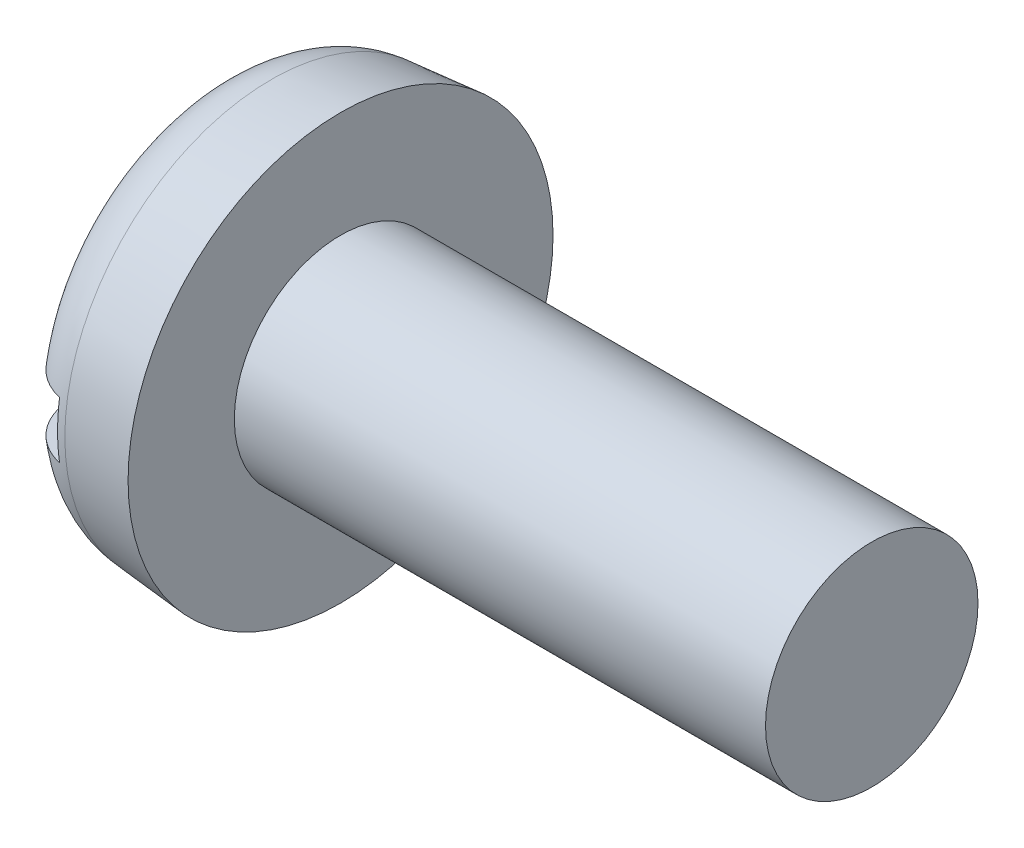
ISO-10303-21;
HEADER;
FILE_DESCRIPTION(('STEP AP214'),'2;1');
FILE_NAME('part.step','',(''),(''),'','','');
FILE_SCHEMA(('AUTOMOTIVE_DESIGN { 1 0 10303 214 1 1 1 1 }'));
ENDSEC;
DATA;
#1=APPLICATION_CONTEXT('core data for automotive mechanical design processes');
#2=APPLICATION_PROTOCOL_DEFINITION('international standard','automotive_design',2000,#1);
#3=PRODUCT_CONTEXT('',#1,'mechanical');
#4=PRODUCT('Part','Part','',(#3));
#5=PRODUCT_RELATED_PRODUCT_CATEGORY('part','',(#4));
#6=PRODUCT_DEFINITION_FORMATION('','',#4);
#7=PRODUCT_DEFINITION_CONTEXT('part definition',#1,'design');
#8=PRODUCT_DEFINITION('design','',#6,#7);
#9=PRODUCT_DEFINITION_SHAPE('','',#8);
#10=(LENGTH_UNIT() NAMED_UNIT(*) SI_UNIT(.MILLI.,.METRE.));
#11=(NAMED_UNIT(*) PLANE_ANGLE_UNIT() SI_UNIT($,.RADIAN.));
#12=(NAMED_UNIT(*) SI_UNIT($,.STERADIAN.) SOLID_ANGLE_UNIT());
#13=UNCERTAINTY_MEASURE_WITH_UNIT(LENGTH_MEASURE(1.E-05),#10,'distance_accuracy_value','');
#14=(GEOMETRIC_REPRESENTATION_CONTEXT(3) GLOBAL_UNCERTAINTY_ASSIGNED_CONTEXT((#13)) GLOBAL_UNIT_ASSIGNED_CONTEXT((#10,
#11,#12)) REPRESENTATION_CONTEXT('',''));
#15=CARTESIAN_POINT('',(0.,0.,0.));
#16=DIRECTION('',(0.,0.,1.));
#17=DIRECTION('',(1.,0.,0.));
#18=AXIS2_PLACEMENT_3D('',#15,#16,#17);
#19=CARTESIAN_POINT('',(0.,0.,0.));
#20=DIRECTION('',(-1.,0.,0.));
#21=DIRECTION('',(0.,0.,1.));
#22=AXIS2_PLACEMENT_3D('',#19,#20,#21);
#23=PLANE('',#22);
#24=DIRECTION('',(0.,0.,-1.));
#25=VECTOR('',#24,1.);
#26=CARTESIAN_POINT('',(0.,0.799999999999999,6.));
#27=LINE('',#26,#25);
#28=CARTESIAN_POINT('',(0.,0.799999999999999,3.9555566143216));
#29=VERTEX_POINT('',#28);
#30=CARTESIAN_POINT('',(0.,0.799999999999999,-3.9555566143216));
#31=VERTEX_POINT('',#30);
#32=EDGE_CURVE('E85',#29,#31,#27,.T.);
#33=ORIENTED_EDGE('',*,*,#32,.F.);
#34=CARTESIAN_POINT('',(0.,0.,0.));
#35=DIRECTION('',(-1.,0.,0.));
#36=DIRECTION('',(0.,0.,1.));
#37=AXIS2_PLACEMENT_3D('',#34,#35,#36);
#38=CIRCLE('',#37,4.03564469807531);
#39=EDGE_CURVE('E91',#29,#31,#38,.T.);
#40=ORIENTED_EDGE('',*,*,#39,.T.);
#41=EDGE_LOOP('',(#33,#40));
#42=FACE_BOUND('',#41,.T.);
#43=ADVANCED_FACE('F32',(#42),#23,.T.);
#44=CARTESIAN_POINT('',(-25.4,0.,0.));
#45=DIRECTION('',(-1.,0.,0.));
#46=DIRECTION('',(0.,0.,1.));
#47=AXIS2_PLACEMENT_3D('',#44,#45,#46);
#48=CYLINDRICAL_SURFACE('',#47,3.);
#49=CARTESIAN_POINT('',(18.6,0.,0.));
#50=DIRECTION('',(-1.,0.,0.));
#51=DIRECTION('',(0.,0.,1.));
#52=AXIS2_PLACEMENT_3D('',#49,#50,#51);
#53=CIRCLE('',#52,3.);
#54=CARTESIAN_POINT('',(18.6,0.,3.));
#55=VERTEX_POINT('',#54);
#56=EDGE_CURVE('E92',#55,#55,#53,.T.);
#57=ORIENTED_EDGE('',*,*,#56,.T.);
#58=EDGE_LOOP('',(#57));
#59=FACE_BOUND('',#58,.T.);
#60=CARTESIAN_POINT('',(3.6,0.,0.));
#61=DIRECTION('',(-1.,0.,0.));
#62=DIRECTION('',(0.,0.,1.));
#63=AXIS2_PLACEMENT_3D('',#60,#61,#62);
#64=CIRCLE('',#63,3.);
#65=CARTESIAN_POINT('',(3.6,0.,3.));
#66=VERTEX_POINT('',#65);
#67=EDGE_CURVE('E149',#66,#66,#64,.T.);
#68=ORIENTED_EDGE('',*,*,#67,.F.);
#69=EDGE_LOOP('',(#68));
#70=FACE_BOUND('',#69,.T.);
#71=ADVANCED_FACE('F137',(#59,#70),#48,.T.);
#72=CARTESIAN_POINT('',(18.6,3.,0.));
#73=DIRECTION('',(1.,0.,0.));
#74=DIRECTION('',(0.,0.,-1.));
#75=AXIS2_PLACEMENT_3D('',#72,#73,#74);
#76=PLANE('',#75);
#77=ORIENTED_EDGE('',*,*,#56,.F.);
#78=EDGE_LOOP('',(#77));
#79=FACE_BOUND('',#78,.T.);
#80=ADVANCED_FACE('F135',(#79),#76,.T.);
#81=DIRECTION('',(0.,0.,1.));
#82=VECTOR('',#81,1.);
#83=CARTESIAN_POINT('',(0.,-0.799999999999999,-6.));
#84=LINE('',#83,#82);
#85=CARTESIAN_POINT('',(0.,-0.799999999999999,-3.9555566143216));
#86=VERTEX_POINT('',#85);
#87=CARTESIAN_POINT('',(0.,-0.800000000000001,3.9555566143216));
#88=VERTEX_POINT('',#87);
#89=EDGE_CURVE('E76',#86,#88,#84,.T.);
#90=ORIENTED_EDGE('',*,*,#89,.F.);
#91=EDGE_CURVE('E83',#86,#88,#38,.T.);
#92=ORIENTED_EDGE('',*,*,#91,.T.);
#93=EDGE_LOOP('',(#90,#92));
#94=FACE_BOUND('',#93,.T.);
#95=ADVANCED_FACE('F82',(#94),#23,.T.);
#96=CARTESIAN_POINT('',(0.,0.,0.));
#97=DIRECTION('',(1.,0.,0.));
#98=DIRECTION('',(0.,0.,-1.));
#99=AXIS2_PLACEMENT_3D('',#96,#97,#98);
#100=CONICAL_SURFACE('',#99,5.68504081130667,0.0872664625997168);
#101=CARTESIAN_POINT('',(1.64311966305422,0.,0.));
#102=DIRECTION('',(-1.,0.,0.));
#103=DIRECTION('',(0.,0.,1.));
#104=AXIS2_PLACEMENT_3D('',#101,#102,#103);
#105=CIRCLE('',#104,5.82879515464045);
#106=CARTESIAN_POINT('',(1.64311966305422,0.,5.82879515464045));
#107=VERTEX_POINT('',#106);
#108=EDGE_CURVE('E95',#107,#107,#105,.F.);
#109=ORIENTED_EDGE('',*,*,#108,.T.);
#110=EDGE_LOOP('',(#109));
#111=FACE_BOUND('',#110,.T.);
#112=CARTESIAN_POINT('',(3.6,0.,0.));
#113=DIRECTION('',(-1.,0.,0.));
#114=DIRECTION('',(0.,0.,1.));
#115=AXIS2_PLACEMENT_3D('',#112,#113,#114);
#116=CIRCLE('',#115,6.);
#117=CARTESIAN_POINT('',(3.6,0.,6.));
#118=VERTEX_POINT('',#117);
#119=EDGE_CURVE('E97',#118,#118,#116,.T.);
#120=ORIENTED_EDGE('',*,*,#119,.T.);
#121=EDGE_LOOP('',(#120));
#122=FACE_BOUND('',#121,.T.);
#123=ADVANCED_FACE('F128',(#111,#122),#100,.T.);
#124=CARTESIAN_POINT('',(3.6,3.,0.));
#125=DIRECTION('',(-1.,0.,0.));
#126=DIRECTION('',(0.,0.,1.));
#127=AXIS2_PLACEMENT_3D('',#124,#125,#126);
#128=PLANE('',#127);
#129=ORIENTED_EDGE('',*,*,#119,.F.);
#130=EDGE_LOOP('',(#129));
#131=FACE_BOUND('',#130,.T.);
#132=ORIENTED_EDGE('',*,*,#67,.T.);
#133=EDGE_LOOP('',(#132));
#134=FACE_BOUND('',#133,.T.);
#135=ADVANCED_FACE('F124',(#131,#134),#128,.F.);
#136=CARTESIAN_POINT('',(1.8,0.,0.));
#137=DIRECTION('',(-1.,0.,0.));
#138=DIRECTION('',(0.,0.,1.));
#139=AXIS2_PLACEMENT_3D('',#136,#137,#138);
#140=TOROIDAL_SURFACE('',#139,4.03564469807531,1.8);
#141=CARTESIAN_POINT('',(0.540762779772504,0.799999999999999,-5.2613759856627));
#142=CARTESIAN_POINT('',(0.612348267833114,0.799999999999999,-5.33226007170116));
#143=CARTESIAN_POINT('',(0.689931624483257,0.799999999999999,-5.3971854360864));
#144=CARTESIAN_POINT('',(0.854947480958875,0.799999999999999,-5.51316161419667));
#145=CARTESIAN_POINT('',(0.94239068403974,0.799999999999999,-5.56419714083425));
#146=CARTESIAN_POINT('',(1.12461220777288,0.799999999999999,-5.650821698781));
#147=CARTESIAN_POINT('',(1.21938917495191,0.799999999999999,-5.6864135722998));
#148=CARTESIAN_POINT('',(1.41356630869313,0.799999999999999,-5.74109194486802));
#149=CARTESIAN_POINT('',(1.51296538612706,0.799999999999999,-5.76018231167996));
#150=CARTESIAN_POINT('',(1.71313899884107,0.799999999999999,-5.78126121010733));
#151=CARTESIAN_POINT('',(1.81390602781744,0.799999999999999,-5.78332104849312));
#152=CARTESIAN_POINT('',(2.01435310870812,0.799999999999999,-5.77046455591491));
#153=CARTESIAN_POINT('',(2.11403314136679,0.799999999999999,-5.75554792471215));
#154=CARTESIAN_POINT('',(2.309314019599,0.799999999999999,-5.70921606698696));
#155=CARTESIAN_POINT('',(2.40492104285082,0.799999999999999,-5.67782686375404));
#156=CARTESIAN_POINT('',(2.58952927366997,0.799999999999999,-5.59948776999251));
#157=CARTESIAN_POINT('',(2.67853045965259,0.799999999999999,-5.55253782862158));
#158=CARTESIAN_POINT('',(2.84769451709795,0.799999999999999,-5.44428887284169));
#159=CARTESIAN_POINT('',(2.92783091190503,0.799999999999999,-5.38294849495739));
#160=CARTESIAN_POINT('',(3.07676159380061,0.799999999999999,-5.24777626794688));
#161=CARTESIAN_POINT('',(3.1455556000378,0.799999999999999,-5.17394410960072));
#162=CARTESIAN_POINT('',(3.27042510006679,0.799999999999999,-5.01531035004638));
#163=CARTESIAN_POINT('',(3.32640120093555,0.799999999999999,-4.93043053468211));
#164=CARTESIAN_POINT('',(3.4235057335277,0.799999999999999,-4.75256933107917));
#165=CARTESIAN_POINT('',(3.46463341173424,0.799999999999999,-4.65958753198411));
#166=CARTESIAN_POINT('',(3.53144158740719,0.799999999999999,-4.46694835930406));
#167=CARTESIAN_POINT('',(3.55692557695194,0.799999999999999,-4.36722286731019));
#168=CARTESIAN_POINT('',(3.59108701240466,0.799999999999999,-4.16493761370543));
#169=CARTESIAN_POINT('',(3.59976314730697,0.799999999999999,-4.06237763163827));
#170=CARTESIAN_POINT('',(3.60023112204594,0.799999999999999,-3.85550711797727));
#171=CARTESIAN_POINT('',(3.59173848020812,0.799999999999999,-3.75119596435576));
#172=CARTESIAN_POINT('',(3.55768438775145,0.799999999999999,-3.54539907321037));
#173=CARTESIAN_POINT('',(3.53212117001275,0.799999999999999,-3.44391362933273));
#174=CARTESIAN_POINT('',(3.46412322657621,0.799999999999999,-3.24471369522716));
#175=CARTESIAN_POINT('',(3.42139292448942,0.799999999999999,-3.14710004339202));
#176=CARTESIAN_POINT('',(3.32030286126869,0.799999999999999,-2.96031799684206));
#177=CARTESIAN_POINT('',(3.26194098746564,0.799999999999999,-2.87115074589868));
#178=CARTESIAN_POINT('',(3.13053846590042,0.799999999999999,-2.70303664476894));
#179=CARTESIAN_POINT('',(3.05736818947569,0.799999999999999,-2.62419095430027));
#180=CARTESIAN_POINT('',(2.89859048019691,0.799999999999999,-2.48017518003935));
#181=CARTESIAN_POINT('',(2.81298317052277,0.799999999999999,-2.41500496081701));
#182=CARTESIAN_POINT('',(2.6334271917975,0.799999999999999,-2.30187272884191));
#183=CARTESIAN_POINT('',(2.53967929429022,0.799999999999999,-2.25359299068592));
#184=CARTESIAN_POINT('',(2.34507363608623,0.799999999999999,-2.17455467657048));
#185=CARTESIAN_POINT('',(2.24421969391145,0.799999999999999,-2.14378676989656));
#186=CARTESIAN_POINT('',(2.04443930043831,0.799999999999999,-2.10254396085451));
#187=CARTESIAN_POINT('',(1.94573097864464,0.799999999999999,-2.09101175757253));
#188=CARTESIAN_POINT('',(1.74783816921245,0.799999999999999,-2.08550669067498));
#189=CARTESIAN_POINT('',(1.64865381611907,0.799999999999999,-2.09152912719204));
#190=CARTESIAN_POINT('',(1.45702700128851,0.799999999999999,-2.12018138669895));
#191=CARTESIAN_POINT('',(1.36447664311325,0.799999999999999,-2.14209986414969));
#192=CARTESIAN_POINT('',(1.18420660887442,0.799999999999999,-2.20075771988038));
#193=CARTESIAN_POINT('',(1.09648771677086,0.799999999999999,-2.23749949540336));
#194=CARTESIAN_POINT('',(0.925723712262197,0.799999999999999,-2.32557805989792));
#195=CARTESIAN_POINT('',(0.842868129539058,0.799999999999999,-2.37728131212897));
#196=CARTESIAN_POINT('',(0.686362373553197,0.799999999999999,-2.493116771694));
#197=CARTESIAN_POINT('',(0.612714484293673,0.799999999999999,-2.55725205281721));
#198=CARTESIAN_POINT('',(0.472161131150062,0.799999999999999,-2.70027682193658));
#199=CARTESIAN_POINT('',(0.405916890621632,0.799999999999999,-2.77981681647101));
#200=CARTESIAN_POINT('',(0.287173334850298,0.799999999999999,-2.9485732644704));
#201=CARTESIAN_POINT('',(0.234676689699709,0.799999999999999,-3.03779159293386));
#202=CARTESIAN_POINT('',(0.143214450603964,0.799999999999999,-3.22677844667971));
#203=CARTESIAN_POINT('',(0.104782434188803,0.799999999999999,-3.32680584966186));
#204=CARTESIAN_POINT('',(0.0452446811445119,0.799999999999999,-3.5318922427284));
#205=CARTESIAN_POINT('',(0.0241387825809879,0.799999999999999,-3.63695118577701));
#206=CARTESIAN_POINT('',(-1.12670491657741E-05,0.799999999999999,-3.84916824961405));
#207=CARTESIAN_POINT('',(-0.00304965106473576,0.799999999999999,-3.95632702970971));
#208=CARTESIAN_POINT('',(0.00921984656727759,0.799999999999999,-4.16962319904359));
#209=CARTESIAN_POINT('',(0.0245310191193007,0.799999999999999,-4.27576040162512));
#210=CARTESIAN_POINT('',(0.0728327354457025,0.799999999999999,-4.48216521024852));
#211=CARTESIAN_POINT('',(0.105541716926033,0.799999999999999,-4.58249883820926));
#212=CARTESIAN_POINT('',(0.187634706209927,0.799999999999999,-4.77599767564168));
#213=CARTESIAN_POINT('',(0.236996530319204,0.799999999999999,-4.86917222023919));
#214=CARTESIAN_POINT('',(0.329466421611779,0.799999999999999,-5.01228034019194));
#215=CARTESIAN_POINT('',(0.367921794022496,0.799999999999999,-5.06527765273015));
#216=CARTESIAN_POINT('',(0.450329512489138,0.799999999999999,-5.16681267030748));
#217=CARTESIAN_POINT('',(0.494281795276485,0.799999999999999,-5.21535042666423));
#218=CARTESIAN_POINT('',(0.540762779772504,0.799999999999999,-5.2613759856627));
#219=B_SPLINE_CURVE_WITH_KNOTS('',3,(#141,#142,#143,#144,#145,#146,#147,#148,#149,#150,#151,
#152,#153,#154,#155,#156,#157,#158,#159,#160,#161,#162,#163,#164,#165,#166,#167,#168,#169,#170,
#171,#172,#173,#174,#175,#176,#177,#178,#179,#180,#181,#182,#183,#184,#185,#186,#187,#188,#189,
#190,#191,#192,#193,#194,#195,#196,#197,#198,#199,#200,#201,#202,#203,#204,#205,#206,#207,#208,
#209,#210,#211,#212,#213,#214,#215,#216,#217,#218),.UNSPECIFIED.,.T.,.F.,(4,2,2,2,2,2,2,2,2,2,2,
2,2,2,2,2,2,2,2,2,2,2,2,2,2,2,2,2,2,2,2,2,2,2,2,2,2,2,4),(0.,0.301990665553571,
0.604312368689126,0.906578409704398,1.20877358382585,1.50970282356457,1.81063738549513,
2.11109795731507,2.41155951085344,2.71289551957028,3.01423898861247,3.31784547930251,
3.6214673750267,3.92882908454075,4.23621476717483,4.54873547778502,4.86128854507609,
5.17947093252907,5.49769634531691,5.81883829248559,6.13997705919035,6.45470120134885,
6.76925749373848,7.06587349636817,7.36241009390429,7.64643650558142,7.93050886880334,
8.22223277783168,8.51402890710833,8.8231740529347,9.13237919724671,9.45232886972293,
9.77227555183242,10.0923243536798,10.4124305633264,10.7275071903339,11.042165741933,
11.2382527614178,11.4343375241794),.UNSPECIFIED.);
#220=CARTESIAN_POINT('',(1.4,0.799999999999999,-5.73510972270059));
#221=VERTEX_POINT('',#220);
#222=EDGE_CURVE('E11',#31,#221,#219,.T.);
#223=ORIENTED_EDGE('',*,*,#222,.F.);
#224=ORIENTED_EDGE('',*,*,#39,.F.);
#225=CARTESIAN_POINT('',(0.836266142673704,0.799999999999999,2.3847675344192));
#226=CARTESIAN_POINT('',(0.917616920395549,0.799999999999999,2.33037611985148));
#227=CARTESIAN_POINT('',(1.00338812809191,0.799999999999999,2.28250940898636));
#228=CARTESIAN_POINT('',(1.18171371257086,0.799999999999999,2.20157945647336));
#229=CARTESIAN_POINT('',(1.27427138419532,0.799999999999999,2.16852346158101));
#230=CARTESIAN_POINT('',(1.46387360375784,0.799999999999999,2.11861651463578));
#231=CARTESIAN_POINT('',(1.56092620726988,0.799999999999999,2.10179593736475));
#232=CARTESIAN_POINT('',(1.75645828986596,0.799999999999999,2.08531619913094));
#233=CARTESIAN_POINT('',(1.85493729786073,0.799999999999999,2.08565149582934));
#234=CARTESIAN_POINT('',(2.04724581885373,0.799999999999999,2.10316628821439));
#235=CARTESIAN_POINT('',(2.1411242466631,0.799999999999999,2.11981673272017));
#236=CARTESIAN_POINT('',(2.32483197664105,0.799999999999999,2.16840533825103));
#237=CARTESIAN_POINT('',(2.41466058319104,0.799999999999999,2.20034611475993));
#238=CARTESIAN_POINT('',(2.58937479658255,0.799999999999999,2.27883470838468));
#239=CARTESIAN_POINT('',(2.67416016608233,0.799999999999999,2.32560484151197));
#240=CARTESIAN_POINT('',(2.83527159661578,0.799999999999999,2.43194790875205));
#241=CARTESIAN_POINT('',(2.91159566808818,0.799999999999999,2.4915238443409));
#242=CARTESIAN_POINT('',(3.05833847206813,0.799999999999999,2.62557742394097));
#243=CARTESIAN_POINT('',(3.12814463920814,0.799999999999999,2.70072607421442));
#244=CARTESIAN_POINT('',(3.25476371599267,0.799999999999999,2.86127427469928));
#245=CARTESIAN_POINT('',(3.31157384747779,0.799999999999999,2.94667601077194));
#246=CARTESIAN_POINT('',(3.41282909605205,0.799999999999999,3.12914373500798));
#247=CARTESIAN_POINT('',(3.4566732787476,0.799999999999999,3.22654397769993));
#248=CARTESIAN_POINT('',(3.52749042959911,0.799999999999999,3.42730182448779));
#249=CARTESIAN_POINT('',(3.55446245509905,0.799999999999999,3.53065976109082));
#250=CARTESIAN_POINT('',(3.59074777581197,0.799999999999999,3.74099682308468));
#251=CARTESIAN_POINT('',(3.59996828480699,0.799999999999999,3.84799201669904));
#252=CARTESIAN_POINT('',(3.60003154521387,0.799999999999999,4.06199242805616));
#253=CARTESIAN_POINT('',(3.59087543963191,0.799999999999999,4.16899764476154));
#254=CARTESIAN_POINT('',(3.5545508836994,0.799999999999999,4.37828946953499));
#255=CARTESIAN_POINT('',(3.5276490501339,0.799999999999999,4.48062230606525));
#256=CARTESIAN_POINT('',(3.45672417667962,0.799999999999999,4.67917518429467));
#257=CARTESIAN_POINT('',(3.41270279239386,0.799999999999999,4.77539581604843));
#258=CARTESIAN_POINT('',(3.30967441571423,0.799999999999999,4.95711293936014));
#259=CARTESIAN_POINT('',(3.2509575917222,0.799999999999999,5.04277397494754));
#260=CARTESIAN_POINT('',(3.11977209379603,0.799999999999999,5.20282644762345));
#261=CARTESIAN_POINT('',(3.04730458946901,0.799999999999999,5.27721884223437));
#262=CARTESIAN_POINT('',(2.89186263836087,0.799999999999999,5.41145672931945));
#263=CARTESIAN_POINT('',(2.80906226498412,0.799999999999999,5.47150384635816));
#264=CARTESIAN_POINT('',(2.63447307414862,0.799999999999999,5.57667826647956));
#265=CARTESIAN_POINT('',(2.54268479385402,0.799999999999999,5.62180646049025));
#266=CARTESIAN_POINT('',(2.35372245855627,0.799999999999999,5.69541178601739));
#267=CARTESIAN_POINT('',(2.25661170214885,0.799999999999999,5.72405148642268));
#268=CARTESIAN_POINT('',(2.05894963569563,0.799999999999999,5.76452632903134));
#269=CARTESIAN_POINT('',(1.95839844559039,0.799999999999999,5.77636205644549));
#270=CARTESIAN_POINT('',(1.75726466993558,0.799999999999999,5.78286013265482));
#271=CARTESIAN_POINT('',(1.65668492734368,0.799999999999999,5.77761084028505));
#272=CARTESIAN_POINT('',(1.45783846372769,0.799999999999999,5.75028865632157));
#273=CARTESIAN_POINT('',(1.35957171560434,0.799999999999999,5.72821596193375));
#274=CARTESIAN_POINT('',(1.16819371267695,0.799999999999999,5.66791633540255));
#275=CARTESIAN_POINT('',(1.07507939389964,0.799999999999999,5.62969912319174));
#276=CARTESIAN_POINT('',(0.896555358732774,0.799999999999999,5.53823241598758));
#277=CARTESIAN_POINT('',(0.811145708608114,0.799999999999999,5.4849827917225));
#278=CARTESIAN_POINT('',(0.650082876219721,0.799999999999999,5.36476593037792));
#279=CARTESIAN_POINT('',(0.574468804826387,0.799999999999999,5.29774630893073));
#280=CARTESIAN_POINT('',(0.435451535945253,0.799999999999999,5.15205983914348));
#281=CARTESIAN_POINT('',(0.372048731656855,0.799999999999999,5.07339261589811));
#282=CARTESIAN_POINT('',(0.258650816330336,0.799999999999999,4.90594446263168));
#283=CARTESIAN_POINT('',(0.208774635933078,0.799999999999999,4.81708301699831));
#284=CARTESIAN_POINT('',(0.124428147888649,0.799999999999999,4.63233098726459));
#285=CARTESIAN_POINT('',(0.0899587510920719,0.799999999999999,4.53643998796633));
#286=CARTESIAN_POINT('',(0.0368868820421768,0.799999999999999,4.33899079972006));
#287=CARTESIAN_POINT('',(0.0185025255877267,0.799999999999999,4.23737401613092));
#288=CARTESIAN_POINT('',(-0.00125734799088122,0.799999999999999,4.03250747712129));
#289=CARTESIAN_POINT('',(-0.00263209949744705,0.799999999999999,3.9292576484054));
#290=CARTESIAN_POINT('',(0.0116307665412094,0.799999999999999,3.72214563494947));
#291=CARTESIAN_POINT('',(0.0275632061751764,0.799999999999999,3.61830377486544));
#292=CARTESIAN_POINT('',(0.0763335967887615,0.799999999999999,3.41464106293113));
#293=CARTESIAN_POINT('',(0.10917724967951,0.799999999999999,3.31482157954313));
#294=CARTESIAN_POINT('',(0.191511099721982,0.799999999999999,3.12021092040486));
#295=CARTESIAN_POINT('',(0.241286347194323,0.799999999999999,3.02554040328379));
#296=CARTESIAN_POINT('',(0.355915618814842,0.799999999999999,2.8458978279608));
#297=CARTESIAN_POINT('',(0.420755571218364,0.799999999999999,2.76091682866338));
#298=CARTESIAN_POINT('',(0.543269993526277,0.799999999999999,2.62572980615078));
#299=CARTESIAN_POINT('',(0.597683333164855,0.799999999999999,2.57253239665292));
#300=CARTESIAN_POINT('',(0.712598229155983,0.799999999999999,2.4731680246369));
#301=CARTESIAN_POINT('',(0.773099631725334,0.799999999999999,2.42700088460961));
#302=CARTESIAN_POINT('',(0.836266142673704,0.799999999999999,2.3847675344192));
#303=B_SPLINE_CURVE_WITH_KNOTS('',3,(#225,#226,#227,#228,#229,#230,#231,#232,#233,#234,#235,
#236,#237,#238,#239,#240,#241,#242,#243,#244,#245,#246,#247,#248,#249,#250,#251,#252,#253,#254,
#255,#256,#257,#258,#259,#260,#261,#262,#263,#264,#265,#266,#267,#268,#269,#270,#271,#272,#273,
#274,#275,#276,#277,#278,#279,#280,#281,#282,#283,#284,#285,#286,#287,#288,#289,#290,#291,#292,
#293,#294,#295,#296,#297,#298,#299,#300,#301,#302),.UNSPECIFIED.,.T.,.F.,(4,2,2,2,2,2,2,2,2,2,2,
2,2,2,2,2,2,2,2,2,2,2,2,2,2,2,2,2,2,2,2,2,2,2,2,2,2,2,4),(0.,0.293321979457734,
0.586787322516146,0.880800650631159,1.17471899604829,1.45941156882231,1.74415285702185,
2.03338255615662,2.32268012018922,2.62901646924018,2.93541824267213,3.25435495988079,
3.57330949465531,3.89392670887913,4.21452398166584,4.53041098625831,4.84626744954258,
5.1563211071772,5.46634840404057,5.77172128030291,6.0770759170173,6.37936593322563,
6.6816454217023,6.98236409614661,7.2830792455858,7.5836136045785,7.88415054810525,
8.18585270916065,8.48756458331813,8.79184901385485,9.09615143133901,9.40451898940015,
9.71290042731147,10.0266186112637,10.3404426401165,10.6598354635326,10.9789311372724,
11.2066928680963,11.43444884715),.UNSPECIFIED.);
#304=CARTESIAN_POINT('',(1.4,0.799999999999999,5.73510972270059));
#305=VERTEX_POINT('',#304);
#306=EDGE_CURVE('E109',#305,#29,#303,.T.);
#307=ORIENTED_EDGE('',*,*,#306,.F.);
#308=CARTESIAN_POINT('',(1.4,0.,0.));
#309=DIRECTION('',(-1.,0.,0.));
#310=DIRECTION('',(0.,0.,1.));
#311=AXIS2_PLACEMENT_3D('',#308,#309,#310);
#312=CIRCLE('',#311,5.79063757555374);
#313=CARTESIAN_POINT('',(1.4,-0.800000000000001,5.73510972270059));
#314=VERTEX_POINT('',#313);
#315=EDGE_CURVE('E103',#305,#314,#312,.F.);
#316=ORIENTED_EDGE('',*,*,#315,.T.);
#317=CARTESIAN_POINT('',(0.836266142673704,-0.8,2.3847675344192));
#318=CARTESIAN_POINT('',(0.748506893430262,-0.8,2.44345191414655));
#319=CARTESIAN_POINT('',(0.665766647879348,-0.8,2.50981960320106));
#320=CARTESIAN_POINT('',(0.512551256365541,-0.8,2.65561376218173));
#321=CARTESIAN_POINT('',(0.442099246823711,-0.8,2.73506432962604));
#322=CARTESIAN_POINT('',(0.315475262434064,-0.8,2.90443495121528));
#323=CARTESIAN_POINT('',(0.259280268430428,-0.8,2.99433778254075));
#324=CARTESIAN_POINT('',(0.162548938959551,-0.8,3.18215299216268));
#325=CARTESIAN_POINT('',(0.122006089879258,-0.8,3.28006201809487));
#326=CARTESIAN_POINT('',(0.0572425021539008,-0.8,3.4827212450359));
#327=CARTESIAN_POINT('',(0.0332676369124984,-0.8,3.58755021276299));
#328=CARTESIAN_POINT('',(0.00342578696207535,-0.8,3.79976969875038));
#329=CARTESIAN_POINT('',(-0.00244009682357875,-0.800000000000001,3.90716037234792));
#330=CARTESIAN_POINT('',(0.00425089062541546,-0.800000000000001,4.12040369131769));
#331=CARTESIAN_POINT('',(0.0166422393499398,-0.800000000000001,4.22626147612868));
#332=CARTESIAN_POINT('',(0.0593599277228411,-0.800000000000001,4.43429705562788));
#333=CARTESIAN_POINT('',(0.0896844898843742,-0.800000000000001,4.53647521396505));
#334=CARTESIAN_POINT('',(0.166811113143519,-0.800000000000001,4.73226366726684));
#335=CARTESIAN_POINT('',(0.21330327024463,-0.800000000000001,4.82599604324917));
#336=CARTESIAN_POINT('',(0.32162267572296,-0.800000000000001,5.00413844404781));
#337=CARTESIAN_POINT('',(0.383448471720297,-0.800000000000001,5.08854935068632));
#338=CARTESIAN_POINT('',(0.519544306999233,-0.800000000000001,5.24416143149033));
#339=CARTESIAN_POINT('',(0.593588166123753,-0.800000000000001,5.31556046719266));
#340=CARTESIAN_POINT('',(0.752739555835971,-0.800000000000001,5.44472836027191));
#341=CARTESIAN_POINT('',(0.837846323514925,-0.800000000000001,5.5024981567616));
#342=CARTESIAN_POINT('',(1.01558854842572,-0.800000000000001,5.60205300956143));
#343=CARTESIAN_POINT('',(1.10812041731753,-0.800000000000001,5.64402306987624));
#344=CARTESIAN_POINT('',(1.29895009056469,-0.800000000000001,5.71170590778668));
#345=CARTESIAN_POINT('',(1.39724763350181,-0.800000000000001,5.7374194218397));
#346=CARTESIAN_POINT('',(1.59606633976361,-0.800000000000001,5.77169733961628));
#347=CARTESIAN_POINT('',(1.69656671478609,-0.800000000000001,5.78038241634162));
#348=CARTESIAN_POINT('',(1.89759433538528,-0.800000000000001,5.78071120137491));
#349=CARTESIAN_POINT('',(1.99812158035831,-0.800000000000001,5.77235526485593));
#350=CARTESIAN_POINT('',(2.19609344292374,-0.800000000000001,5.73889133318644));
#351=CARTESIAN_POINT('',(2.29354498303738,-0.800000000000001,5.71382425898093));
#352=CARTESIAN_POINT('',(2.48286854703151,-0.800000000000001,5.64771711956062));
#353=CARTESIAN_POINT('',(2.57474056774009,-0.800000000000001,5.60667704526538));
#354=CARTESIAN_POINT('',(2.75051258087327,-0.800000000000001,5.50972539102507));
#355=CARTESIAN_POINT('',(2.8343959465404,-0.800000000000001,5.45378367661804));
#356=CARTESIAN_POINT('',(2.99165678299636,-0.800000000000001,5.32869697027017));
#357=CARTESIAN_POINT('',(3.06503402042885,-0.800000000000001,5.25955168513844));
#358=CARTESIAN_POINT('',(3.19973989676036,-0.800000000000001,5.10955333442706));
#359=CARTESIAN_POINT('',(3.26098586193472,-0.800000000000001,5.02862604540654));
#360=CARTESIAN_POINT('',(3.36919753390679,-0.800000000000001,4.85773374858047));
#361=CARTESIAN_POINT('',(3.41616259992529,-0.800000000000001,4.76776833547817));
#362=CARTESIAN_POINT('',(3.49507738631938,-0.800000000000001,4.5802716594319));
#363=CARTESIAN_POINT('',(3.52685014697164,-0.800000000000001,4.48266594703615));
#364=CARTESIAN_POINT('',(3.57383908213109,-0.800000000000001,4.28355151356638));
#365=CARTESIAN_POINT('',(3.58905405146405,-0.800000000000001,4.18204250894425));
#366=CARTESIAN_POINT('',(3.60277332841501,-0.800000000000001,3.97627512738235));
#367=CARTESIAN_POINT('',(3.60100695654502,-0.8,3.87199872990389));
#368=CARTESIAN_POINT('',(3.58032198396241,-0.8,3.66516328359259));
#369=CARTESIAN_POINT('',(3.56140169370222,-0.8,3.56260440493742));
#370=CARTESIAN_POINT('',(3.50655445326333,-0.8,3.3601262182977));
#371=CARTESIAN_POINT('',(3.47032341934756,-0.8,3.26028924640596));
#372=CARTESIAN_POINT('',(3.38182060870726,-0.8,3.06798854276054));
#373=CARTESIAN_POINT('',(3.32954675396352,-0.8,2.97552576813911));
#374=CARTESIAN_POINT('',(3.20964725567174,-0.8,2.79948120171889));
#375=CARTESIAN_POINT('',(3.14184223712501,-0.8,2.71602141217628));
#376=CARTESIAN_POINT('',(2.99302219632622,-0.8,2.56181483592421));
#377=CARTESIAN_POINT('',(2.91200632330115,-0.8,2.49106886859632));
#378=CARTESIAN_POINT('',(2.73997760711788,-0.8,2.36551639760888));
#379=CARTESIAN_POINT('',(2.64910309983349,-0.8,2.31052086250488));
#380=CARTESIAN_POINT('',(2.4590409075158,-0.8,2.21753014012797));
#381=CARTESIAN_POINT('',(2.35985743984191,-0.8,2.17952638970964));
#382=CARTESIAN_POINT('',(2.16147923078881,-0.8,2.12383562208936));
#383=CARTESIAN_POINT('',(2.06255196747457,-0.8,2.10519696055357));
#384=CARTESIAN_POINT('',(1.86294330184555,-0.8,2.08580594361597));
#385=CARTESIAN_POINT('',(1.76226208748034,-0.8,2.08505168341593));
#386=CARTESIAN_POINT('',(1.56749167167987,-0.8,2.1010369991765));
#387=CARTESIAN_POINT('',(1.47332742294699,-0.8,2.11688981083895));
#388=CARTESIAN_POINT('',(1.28901868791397,-0.8,2.16397488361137));
#389=CARTESIAN_POINT('',(1.19886974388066,-0.8,2.19518960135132));
#390=CARTESIAN_POINT('',(1.0638315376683,-0.8,2.25452352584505));
#391=CARTESIAN_POINT('',(1.01673933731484,-0.8,2.27777851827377));
#392=CARTESIAN_POINT('',(0.924773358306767,-0.8,2.32831196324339));
#393=CARTESIAN_POINT('',(0.879899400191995,-0.8,2.35559008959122));
#394=CARTESIAN_POINT('',(0.836266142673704,-0.8,2.3847675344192));
#395=B_SPLINE_CURVE_WITH_KNOTS('',3,(#317,#318,#319,#320,#321,#322,#323,#324,#325,#326,#327,
#328,#329,#330,#331,#332,#333,#334,#335,#336,#337,#338,#339,#340,#341,#342,#343,#344,#345,#346,
#347,#348,#349,#350,#351,#352,#353,#354,#355,#356,#357,#358,#359,#360,#361,#362,#363,#364,#365,
#366,#367,#368,#369,#370,#371,#372,#373,#374,#375,#376,#377,#378,#379,#380,#381,#382,#383,#384,
#385,#386,#387,#388,#389,#390,#391,#392,#393,#394),.UNSPECIFIED.,.T.,.F.,(4,2,2,2,2,2,2,2,2,2,2,
2,2,2,2,2,2,2,2,2,2,2,2,2,2,2,2,2,2,2,2,2,2,2,2,2,2,2,4),(0.,0.316518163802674,
0.633625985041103,0.950218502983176,1.2666791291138,1.58774070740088,1.90882180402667,
2.22700979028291,2.54516624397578,2.8575328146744,3.16986980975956,3.47696670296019,
3.78404242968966,4.08740155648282,4.39074693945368,4.69193476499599,4.99311631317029,
5.29356304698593,5.59400995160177,5.89506910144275,6.19613493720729,6.49918680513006,
6.80225226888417,7.10876667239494,7.41530338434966,7.72673423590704,8.03819576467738,
8.35534173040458,8.6725287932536,8.99358246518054,9.31465682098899,9.63169865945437,
9.94858054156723,10.2490245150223,10.549436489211,10.8345871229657,11.1194128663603,
11.276796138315,11.4341666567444),.UNSPECIFIED.);
#396=EDGE_CURVE('E90',#88,#314,#395,.T.);
#397=ORIENTED_EDGE('',*,*,#396,.F.);
#398=ORIENTED_EDGE('',*,*,#91,.F.);
#399=CARTESIAN_POINT('',(0.540762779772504,-0.799999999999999,-5.2613759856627));
#400=CARTESIAN_POINT('',(0.46800256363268,-0.799999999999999,-5.18931554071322));
#401=CARTESIAN_POINT('',(0.401331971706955,-0.799999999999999,-5.11098969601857));
#402=CARTESIAN_POINT('',(0.282092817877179,-0.799999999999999,-4.94415021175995));
#403=CARTESIAN_POINT('',(0.229543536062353,-0.799999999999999,-4.85562287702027));
#404=CARTESIAN_POINT('',(0.140058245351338,-0.799999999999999,-4.67111833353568));
#405=CARTESIAN_POINT('',(0.103104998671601,-0.799999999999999,-4.57514948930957));
#406=CARTESIAN_POINT('',(0.0456444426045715,-0.799999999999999,-4.37844736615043));
#407=CARTESIAN_POINT('',(0.0251330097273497,-0.799999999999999,-4.27771528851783));
#408=CARTESIAN_POINT('',(0.000807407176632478,-0.799999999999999,-4.07306902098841));
#409=CARTESIAN_POINT('',(-0.00280970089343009,-0.799999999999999,-3.96913144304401));
#410=CARTESIAN_POINT('',(0.00712688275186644,-0.799999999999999,-3.76207815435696));
#411=CARTESIAN_POINT('',(0.0206829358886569,-0.8,-3.65896255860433));
#412=CARTESIAN_POINT('',(0.0648595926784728,-0.8,-3.45448287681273));
#413=CARTESIAN_POINT('',(0.0957869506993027,-0.8,-3.35318504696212));
#414=CARTESIAN_POINT('',(0.173966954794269,-0.8,-3.15709227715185));
#415=CARTESIAN_POINT('',(0.221221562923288,-0.8,-3.06229812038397));
#416=CARTESIAN_POINT('',(0.331523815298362,-0.8,-2.8805427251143));
#417=CARTESIAN_POINT('',(0.394784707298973,-0.8,-2.79371074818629));
#418=CARTESIAN_POINT('',(0.535080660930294,-0.8,-2.63196239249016));
#419=CARTESIAN_POINT('',(0.612117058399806,-0.8,-2.5570471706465));
#420=CARTESIAN_POINT('',(0.777363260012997,-0.8,-2.42207446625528));
#421=CARTESIAN_POINT('',(0.865488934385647,-0.8,-2.36191424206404));
#422=CARTESIAN_POINT('',(1.05097305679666,-0.8,-2.25807126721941));
#423=CARTESIAN_POINT('',(1.1483280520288,-0.8,-2.21438238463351));
#424=CARTESIAN_POINT('',(1.34472607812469,-0.8,-2.14709500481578));
#425=CARTESIAN_POINT('',(1.44348146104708,-0.8,-2.12265879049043));
#426=CARTESIAN_POINT('',(1.64375523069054,-0.8,-2.09184121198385));
#427=CARTESIAN_POINT('',(1.74527230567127,-0.8,-2.08545142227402));
#428=CARTESIAN_POINT('',(1.94205144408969,-0.8,-2.09089422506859));
#429=CARTESIAN_POINT('',(2.03734311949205,-0.8,-2.1017185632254));
#430=CARTESIAN_POINT('',(2.22475371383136,-0.8,-2.1391955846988));
#431=CARTESIAN_POINT('',(2.31687240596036,-0.8,-2.16584939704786));
#432=CARTESIAN_POINT('',(2.49568716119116,-0.8,-2.23389898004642));
#433=CARTESIAN_POINT('',(2.58237134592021,-0.8,-2.27532580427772));
#434=CARTESIAN_POINT('',(2.74807422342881,-0.8,-2.37138684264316));
#435=CARTESIAN_POINT('',(2.82709115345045,-0.8,-2.42602408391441));
#436=CARTESIAN_POINT('',(2.9799165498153,-0.8,-2.55022645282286));
#437=CARTESIAN_POINT('',(3.05318434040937,-0.8,-2.6204569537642));
#438=CARTESIAN_POINT('',(3.18755425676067,-0.8,-2.77172635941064));
#439=CARTESIAN_POINT('',(3.24865355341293,-0.8,-2.85276777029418));
#440=CARTESIAN_POINT('',(3.35979277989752,-0.8,-3.02754470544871));
#441=CARTESIAN_POINT('',(3.40917690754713,-0.8,-3.1216981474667));
#442=CARTESIAN_POINT('',(3.49164209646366,-0.8,-3.31689856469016));
#443=CARTESIAN_POINT('',(3.52472176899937,-0.8,-3.41794612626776));
#444=CARTESIAN_POINT('',(3.57383047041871,-0.8,-3.62528781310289));
#445=CARTESIAN_POINT('',(3.58966846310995,-0.8,-3.73162733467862));
#446=CARTESIAN_POINT('',(3.60302482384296,-0.8,-3.94545563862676));
#447=CARTESIAN_POINT('',(3.60054405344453,-0.799999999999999,-4.05294436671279));
#448=CARTESIAN_POINT('',(3.57730809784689,-0.799999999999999,-4.26456838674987));
#449=CARTESIAN_POINT('',(3.5567824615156,-0.799999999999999,-4.36872882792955));
#450=CARTESIAN_POINT('',(3.49820144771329,-0.799999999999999,-4.57200098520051));
#451=CARTESIAN_POINT('',(3.46014775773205,-0.799999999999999,-4.67111318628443));
#452=CARTESIAN_POINT('',(3.36835841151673,-0.799999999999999,-4.85952398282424));
#453=CARTESIAN_POINT('',(3.31492535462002,-0.799999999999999,-4.94897001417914));
#454=CARTESIAN_POINT('',(3.19357222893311,-0.799999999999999,-5.1174283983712));
#455=CARTESIAN_POINT('',(3.12565341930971,-0.799999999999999,-5.196441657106));
#456=CARTESIAN_POINT('',(2.97843308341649,-0.799999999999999,-5.34047951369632));
#457=CARTESIAN_POINT('',(2.89932889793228,-0.799999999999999,-5.40570586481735));
#458=CARTESIAN_POINT('',(2.73119091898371,-0.799999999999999,-5.52177624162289));
#459=CARTESIAN_POINT('',(2.64215774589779,-0.799999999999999,-5.57262116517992));
#460=CARTESIAN_POINT('',(2.45774484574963,-0.799999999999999,-5.65792437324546));
#461=CARTESIAN_POINT('',(2.36244515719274,-0.799999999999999,-5.69255575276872));
#462=CARTESIAN_POINT('',(2.16736859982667,-0.799999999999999,-5.7452167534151));
#463=CARTESIAN_POINT('',(2.06759209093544,-0.799999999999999,-5.76324770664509));
#464=CARTESIAN_POINT('',(1.8670464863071,-0.799999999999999,-5.78211504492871));
#465=CARTESIAN_POINT('',(1.76628722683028,-0.799999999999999,-5.78305617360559));
#466=CARTESIAN_POINT('',(1.56601778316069,-0.799999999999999,-5.76798048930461));
#467=CARTESIAN_POINT('',(1.46650790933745,-0.799999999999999,-5.75195954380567));
#468=CARTESIAN_POINT('',(1.27169371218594,-0.799999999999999,-5.70345798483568));
#469=CARTESIAN_POINT('',(1.17638560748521,-0.799999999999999,-5.67099251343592));
#470=CARTESIAN_POINT('',(0.992639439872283,-0.799999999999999,-5.59058259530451));
#471=CARTESIAN_POINT('',(0.904192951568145,-0.799999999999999,-5.54265751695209));
#472=CARTESIAN_POINT('',(0.770167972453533,-0.799999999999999,-5.45480755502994));
#473=CARTESIAN_POINT('',(0.72159797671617,-0.799999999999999,-5.41935523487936));
#474=CARTESIAN_POINT('',(0.628240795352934,-0.799999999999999,-5.34377955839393));
#475=CARTESIAN_POINT('',(0.583453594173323,-0.799999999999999,-5.30365622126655));
#476=CARTESIAN_POINT('',(0.540762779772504,-0.799999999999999,-5.2613759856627));
#477=B_SPLINE_CURVE_WITH_KNOTS('',3,(#399,#400,#401,#402,#403,#404,#405,#406,#407,#408,#409,
#410,#411,#412,#413,#414,#415,#416,#417,#418,#419,#420,#421,#422,#423,#424,#425,#426,#427,#428,
#429,#430,#431,#432,#433,#434,#435,#436,#437,#438,#439,#440,#441,#442,#443,#444,#445,#446,#447,
#448,#449,#450,#451,#452,#453,#454,#455,#456,#457,#458,#459,#460,#461,#462,#463,#464,#465,#466,
#467,#468,#469,#470,#471,#472,#473,#474,#475,#476),.UNSPECIFIED.,.T.,.F.,(4,2,2,2,2,2,2,2,2,2,2,
2,2,2,2,2,2,2,2,2,2,2,2,2,2,2,2,2,2,2,2,2,2,2,2,2,2,2,4),(0.,0.306991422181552,0.61439988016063,
0.921467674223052,1.22845843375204,1.53902124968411,1.84962677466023,2.1658978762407,
2.48220699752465,2.80297521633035,3.12377455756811,3.4422723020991,3.76065135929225,
4.06426589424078,4.36773865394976,4.65408102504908,4.94044382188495,5.22741215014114,
5.51444629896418,5.81757894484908,6.12078198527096,6.43825439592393,6.75575384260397,
7.07673643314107,7.39770392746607,7.71464653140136,8.03155862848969,8.34261788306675,
8.65365010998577,8.95975564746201,9.2658420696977,9.56858170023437,9.87129703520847,
10.1721563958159,10.4730890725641,10.7737451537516,11.0740260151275,11.254148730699,
11.4342707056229),.UNSPECIFIED.);
#478=CARTESIAN_POINT('',(1.4,-0.799999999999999,-5.73510972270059));
#479=VERTEX_POINT('',#478);
#480=EDGE_CURVE('E44',#479,#86,#477,.T.);
#481=ORIENTED_EDGE('',*,*,#480,.F.);
#482=EDGE_CURVE('E56',#479,#221,#312,.F.);
#483=ORIENTED_EDGE('',*,*,#482,.T.);
#484=EDGE_LOOP('',(#223,#224,#307,#316,#397,#398,#481,#483));
#485=FACE_BOUND('',#484,.T.);
#486=ORIENTED_EDGE('',*,*,#108,.F.);
#487=EDGE_LOOP('',(#486));
#488=FACE_BOUND('',#487,.T.);
#489=ADVANCED_FACE('F34',(#485,#488),#140,.T.);
#490=CARTESIAN_POINT('',(1.4,0.799999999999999,6.));
#491=DIRECTION('',(0.,1.,0.));
#492=DIRECTION('',(0.,0.,1.));
#493=AXIS2_PLACEMENT_3D('',#490,#491,#492);
#494=PLANE('',#493);
#495=ORIENTED_EDGE('',*,*,#222,.T.);
#496=DIRECTION('',(0.,0.,-1.));
#497=VECTOR('',#496,1.);
#498=CARTESIAN_POINT('',(1.4,0.799999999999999,6.));
#499=LINE('',#498,#497);
#500=EDGE_CURVE('E84',#305,#221,#499,.T.);
#501=ORIENTED_EDGE('',*,*,#500,.F.);
#502=ORIENTED_EDGE('',*,*,#306,.T.);
#503=ORIENTED_EDGE('',*,*,#32,.T.);
#504=EDGE_LOOP('',(#495,#501,#502,#503));
#505=FACE_BOUND('',#504,.T.);
#506=ADVANCED_FACE('F116',(#505),#494,.F.);
#507=CARTESIAN_POINT('',(1.4,-0.799999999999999,-6.));
#508=DIRECTION('',(0.,-1.,0.));
#509=DIRECTION('',(0.,0.,-1.));
#510=AXIS2_PLACEMENT_3D('',#507,#508,#509);
#511=PLANE('',#510);
#512=ORIENTED_EDGE('',*,*,#480,.T.);
#513=ORIENTED_EDGE('',*,*,#89,.T.);
#514=ORIENTED_EDGE('',*,*,#396,.T.);
#515=DIRECTION('',(0.,0.,1.));
#516=VECTOR('',#515,1.);
#517=CARTESIAN_POINT('',(1.4,-0.799999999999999,-6.));
#518=LINE('',#517,#516);
#519=EDGE_CURVE('E51',#479,#314,#518,.T.);
#520=ORIENTED_EDGE('',*,*,#519,.F.);
#521=EDGE_LOOP('',(#512,#513,#514,#520));
#522=FACE_BOUND('',#521,.T.);
#523=ADVANCED_FACE('F75',(#522),#511,.F.);
#524=CARTESIAN_POINT('',(1.4,0.799999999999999,-6.));
#525=DIRECTION('',(-1.,0.,0.));
#526=DIRECTION('',(0.,0.,1.));
#527=AXIS2_PLACEMENT_3D('',#524,#525,#526);
#528=PLANE('',#527);
#529=ORIENTED_EDGE('',*,*,#519,.T.);
#530=ORIENTED_EDGE('',*,*,#315,.F.);
#531=ORIENTED_EDGE('',*,*,#500,.T.);
#532=ORIENTED_EDGE('',*,*,#482,.F.);
#533=EDGE_LOOP('',(#529,#530,#531,#532));
#534=FACE_BOUND('',#533,.T.);
#535=ADVANCED_FACE('F115',(#534),#528,.T.);
#536=CLOSED_SHELL('',(#43,#71,#80,#95,#123,#135,#489,#506,#523,#535));
#537=MANIFOLD_SOLID_BREP('B2',#536);
#538=ADVANCED_BREP_SHAPE_REPRESENTATION('',(#18,#537),#14);
#539=SHAPE_DEFINITION_REPRESENTATION(#9,#538);
ENDSEC;
END-ISO-10303-21;
